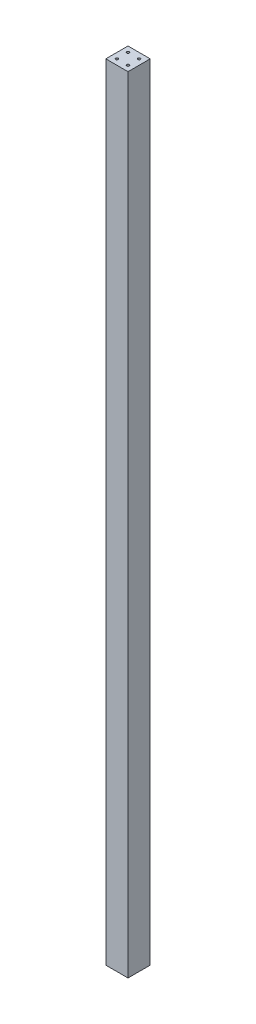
from build123d import *

# Parameters (mm, degrees)
SKETCH_1_W                  = 60
SKETCH_1_H                  = 60
EXTRUDE_1_DEPTH             = 2120
PATTERN_LINEAR_1_COUNT      = 2
PATTERN_LINEAR_1_PITCH      = 30
PATTERN_LINEAR_1_COUNT_DIR2 = 2
PATTERN_LINEAR_1_PITCH_DIR2 = 30
PATTERN_LINEAR_2_COUNT      = 2
PATTERN_LINEAR_2_PITCH      = 30
PATTERN_LINEAR_2_COUNT_DIR2 = 2
PATTERN_LINEAR_2_PITCH_DIR2 = 30


with BuildPart() as part:
    # Sketch 1 → Extrude 1 (new body)
    with BuildSketch(Plane(origin=(0, 0, 0), x_dir=(1, 0, 0), z_dir=(0, 1, 0))):
        Rectangle(SKETCH_1_W, SKETCH_1_H)
    extrude(amount=EXTRUDE_1_DEPTH)

    # Sketch 7 → Hole Wizard M8 _1 (revolve, cut)
    with BuildSketch(Plane(origin=(15, 0, -15), x_dir=(0, 0, -1), z_dir=(1, 0, 0))):
        Polygon((0, 0), (0, 19.75), (3.4, 17.707073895), (3.4, 0), align=None)
    hole_wizard_m8_1 = revolve(axis=Axis((15, -6.35, -15), (0, 1, 0)), mode=Mode.SUBTRACT)

    # Pattern Linear 1: Hole Wizard M8 _1 2 × 2
    with Locations(*[(-i * PATTERN_LINEAR_1_PITCH, 0, j * PATTERN_LINEAR_1_PITCH_DIR2) for i in range(PATTERN_LINEAR_1_COUNT) for j in range(PATTERN_LINEAR_1_COUNT_DIR2) if (i, j) != (0, 0)]):
        add(hole_wizard_m8_1, mode=Mode.SUBTRACT)

    # Sketch 10 → Hole Wizard M8 _2 (revolve, cut)
    with BuildSketch(Plane(origin=(15, 2120, -15), x_dir=(0, 0, 1), z_dir=(1, 0, 0))):
        Polygon((0, 0), (0, 19.75), (3.4, 17.707073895), (3.4, 0), align=None)
    hole_wizard_m8_2 = revolve(axis=Axis((15, 2126.35, -15), (0, -1, 0)), mode=Mode.SUBTRACT)

    # Pattern Linear 2: Hole Wizard M8 _2 2 × 2
    with Locations(*[(-i * PATTERN_LINEAR_2_PITCH, 0, j * PATTERN_LINEAR_2_PITCH_DIR2) for i in range(PATTERN_LINEAR_2_COUNT) for j in range(PATTERN_LINEAR_2_COUNT_DIR2) if (i, j) != (0, 0)]):
        add(hole_wizard_m8_2, mode=Mode.SUBTRACT)


solid = part.part
